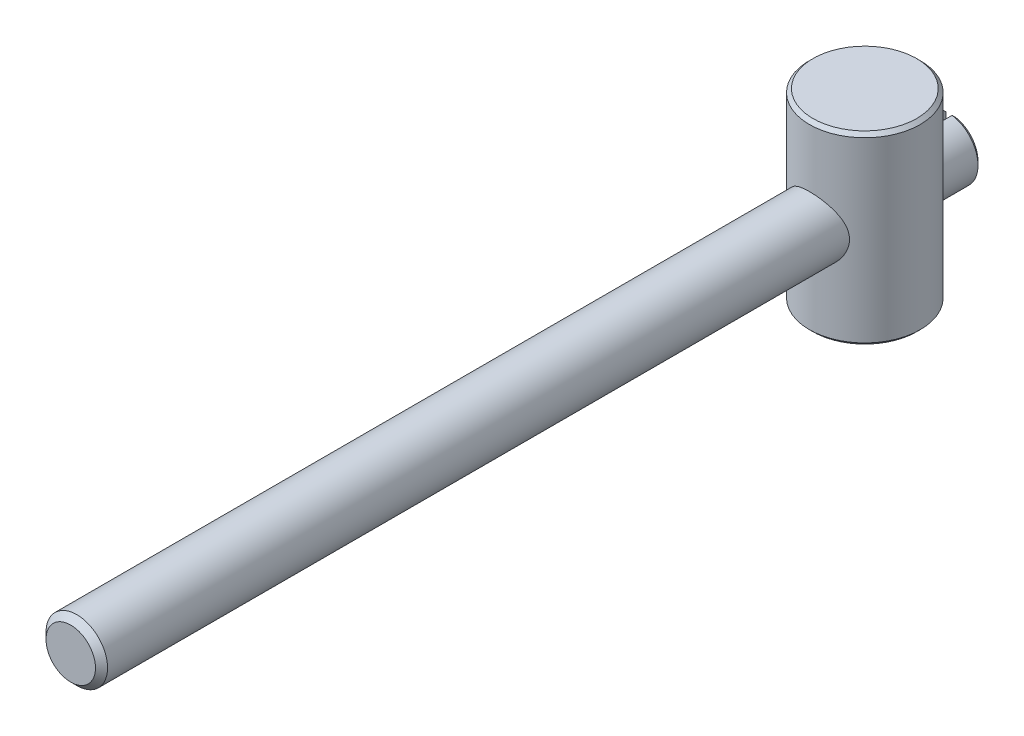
ISO-10303-21;
HEADER;
FILE_DESCRIPTION(('STEP AP214'),'2;1');
FILE_NAME('part.step','',(''),(''),'','','');
FILE_SCHEMA(('AUTOMOTIVE_DESIGN { 1 0 10303 214 1 1 1 1 }'));
ENDSEC;
DATA;
#1=APPLICATION_CONTEXT('core data for automotive mechanical design processes');
#2=APPLICATION_PROTOCOL_DEFINITION('international standard','automotive_design',2000,#1);
#3=PRODUCT_CONTEXT('',#1,'mechanical');
#4=PRODUCT('Part','Part','',(#3));
#5=PRODUCT_RELATED_PRODUCT_CATEGORY('part','',(#4));
#6=PRODUCT_DEFINITION_FORMATION('','',#4);
#7=PRODUCT_DEFINITION_CONTEXT('part definition',#1,'design');
#8=PRODUCT_DEFINITION('design','',#6,#7);
#9=PRODUCT_DEFINITION_SHAPE('','',#8);
#10=(LENGTH_UNIT() NAMED_UNIT(*) SI_UNIT(.MILLI.,.METRE.));
#11=(NAMED_UNIT(*) PLANE_ANGLE_UNIT() SI_UNIT($,.RADIAN.));
#12=(NAMED_UNIT(*) SI_UNIT($,.STERADIAN.) SOLID_ANGLE_UNIT());
#13=UNCERTAINTY_MEASURE_WITH_UNIT(LENGTH_MEASURE(1.E-05),#10,'distance_accuracy_value','');
#14=(GEOMETRIC_REPRESENTATION_CONTEXT(3) GLOBAL_UNCERTAINTY_ASSIGNED_CONTEXT((#13)) GLOBAL_UNIT_ASSIGNED_CONTEXT((#10,
#11,#12)) REPRESENTATION_CONTEXT('',''));
#15=CARTESIAN_POINT('',(0.,0.,0.));
#16=DIRECTION('',(0.,0.,1.));
#17=DIRECTION('',(1.,0.,0.));
#18=AXIS2_PLACEMENT_3D('',#15,#16,#17);
#19=CARTESIAN_POINT('',(0.,0.,-10.2));
#20=DIRECTION('',(0.,0.,1.));
#21=DIRECTION('',(1.,0.,0.));
#22=AXIS2_PLACEMENT_3D('',#19,#20,#21);
#23=CYLINDRICAL_SURFACE('',#22,2.5);
#24=CARTESIAN_POINT('',(2.5,0.,-10.9583426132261));
#25=CARTESIAN_POINT('',(2.4999886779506,-0.127867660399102,-10.9583273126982));
#26=CARTESIAN_POINT('',(2.49012046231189,-0.255847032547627,-10.9516829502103));
#27=CARTESIAN_POINT('',(2.45123834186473,-0.507679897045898,-10.92615160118));
#28=CARTESIAN_POINT('',(2.42219296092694,-0.631526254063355,-10.9072444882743));
#29=CARTESIAN_POINT('',(2.34672518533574,-0.870945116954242,-10.8601006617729));
#30=CARTESIAN_POINT('',(2.30041313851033,-0.986564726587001,-10.8319233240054));
#31=CARTESIAN_POINT('',(2.19206578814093,-1.20834600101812,-10.7695105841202));
#32=CARTESIAN_POINT('',(2.13002699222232,-1.31450555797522,-10.7352738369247));
#33=CARTESIAN_POINT('',(1.98449846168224,-1.52641671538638,-10.6603059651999));
#34=CARTESIAN_POINT('',(1.89945493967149,-1.63099357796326,-10.6192693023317));
#35=CARTESIAN_POINT('',(1.71353751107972,-1.82534633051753,-10.5377770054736));
#36=CARTESIAN_POINT('',(1.61265398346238,-1.91511315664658,-10.4973217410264));
#37=CARTESIAN_POINT('',(1.3870985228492,-2.08508983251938,-10.4173035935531));
#38=CARTESIAN_POINT('',(1.26111369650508,-2.16376032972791,-10.3781335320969));
#39=CARTESIAN_POINT('',(0.995108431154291,-2.29824166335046,-10.3092628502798));
#40=CARTESIAN_POINT('',(0.855099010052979,-2.35407027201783,-10.2795548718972));
#41=CARTESIAN_POINT('',(0.577542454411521,-2.43630568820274,-10.2351937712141));
#42=CARTESIAN_POINT('',(0.440787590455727,-2.46480060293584,-10.2194803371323));
#43=CARTESIAN_POINT('',(0.163616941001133,-2.49853448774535,-10.2008373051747));
#44=CARTESIAN_POINT('',(0.0232040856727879,-2.50379152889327,-10.1978977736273));
#45=CARTESIAN_POINT('',(-0.241178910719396,-2.4914765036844,-10.2047304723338));
#46=CARTESIAN_POINT('',(-0.365303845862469,-2.47628215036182,-10.2131788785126));
#47=CARTESIAN_POINT('',(-0.608906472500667,-2.42789099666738,-10.2397034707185));
#48=CARTESIAN_POINT('',(-0.728383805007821,-2.39469280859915,-10.2577803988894));
#49=CARTESIAN_POINT('',(-0.960979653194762,-2.31126649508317,-10.3021939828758));
#50=CARTESIAN_POINT('',(-1.07401990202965,-2.26086630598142,-10.3286138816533));
#51=CARTESIAN_POINT('',(-1.29025059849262,-2.14483738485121,-10.3874800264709));
#52=CARTESIAN_POINT('',(-1.39343793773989,-2.07920386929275,-10.4199281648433));
#53=CARTESIAN_POINT('',(-1.59909620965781,-1.92640653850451,-10.4921471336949));
#54=CARTESIAN_POINT('',(-1.70025747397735,-1.83767397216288,-10.5323306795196));
#55=CARTESIAN_POINT('',(-1.88703556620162,-1.64533173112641,-10.6134989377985));
#56=CARTESIAN_POINT('',(-1.97263574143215,-1.54170632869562,-10.6544844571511));
#57=CARTESIAN_POINT('',(-2.13367090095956,-1.31107929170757,-10.736876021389));
#58=CARTESIAN_POINT('',(-2.2074790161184,-1.1828097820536,-10.7779828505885));
#59=CARTESIAN_POINT('',(-2.30082855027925,-0.98066900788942,-10.8325082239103));
#60=CARTESIAN_POINT('',(-2.32905476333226,-0.91165285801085,-10.8494965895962));
#61=CARTESIAN_POINT('',(-2.3793879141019,-0.770776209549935,-10.8803947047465));
#62=CARTESIAN_POINT('',(-2.4014990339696,-0.698917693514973,-10.8943065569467));
#63=CARTESIAN_POINT('',(-2.43774893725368,-0.558744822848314,-10.9174339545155));
#64=CARTESIAN_POINT('',(-2.45238335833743,-0.490605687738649,-10.92693581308));
#65=CARTESIAN_POINT('',(-2.47593920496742,-0.352979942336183,-10.9423512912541));
#66=CARTESIAN_POINT('',(-2.48486399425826,-0.283494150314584,-10.9482670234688));
#67=CARTESIAN_POINT('',(-2.49684067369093,-0.143844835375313,-10.9562264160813));
#68=CARTESIAN_POINT('',(-2.49989709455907,-0.0736818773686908,-10.9582730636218));
#69=CARTESIAN_POINT('',(-2.5000979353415,0.0666321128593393,-10.958408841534));
#70=CARTESIAN_POINT('',(-2.49724303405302,0.136783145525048,-10.9564984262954));
#71=CARTESIAN_POINT('',(-2.48160454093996,0.325212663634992,-10.9460933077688));
#72=CARTESIAN_POINT('',(-2.4632791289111,0.442885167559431,-10.9339318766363));
#73=CARTESIAN_POINT('',(-2.41059641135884,0.673061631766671,-10.9000032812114));
#74=CARTESIAN_POINT('',(-2.37623178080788,0.785563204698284,-10.8782317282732));
#75=CARTESIAN_POINT('',(-2.29111009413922,1.00774180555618,-10.8265799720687));
#76=CARTESIAN_POINT('',(-2.23973536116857,1.11711092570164,-10.796402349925));
#77=CARTESIAN_POINT('',(-2.12255957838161,1.32632576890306,-10.7314706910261));
#78=CARTESIAN_POINT('',(-2.05675148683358,1.42616680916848,-10.6967144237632));
#79=CARTESIAN_POINT('',(-1.90016864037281,1.63049062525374,-10.6197869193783));
#80=CARTESIAN_POINT('',(-1.80707526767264,1.73309682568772,-10.5773277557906));
#81=CARTESIAN_POINT('',(-1.60470900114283,1.92199935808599,-10.4944234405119));
#82=CARTESIAN_POINT('',(-1.49542618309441,2.00828561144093,-10.453979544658));
#83=CARTESIAN_POINT('',(-1.25626042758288,2.16643294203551,-10.376991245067));
#84=CARTESIAN_POINT('',(-1.12558547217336,2.23726807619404,-10.3407737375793));
#85=CARTESIAN_POINT('',(-0.851602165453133,2.35519631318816,-10.2790936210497));
#86=CARTESIAN_POINT('',(-0.708307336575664,2.40231447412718,-10.2536196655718));
#87=CARTESIAN_POINT('',(-0.428990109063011,2.46664777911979,-10.218514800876));
#88=CARTESIAN_POINT('',(-0.293732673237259,2.48643742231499,-10.2075252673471));
#89=CARTESIAN_POINT('',(-0.0213910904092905,2.50362240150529,-10.1979932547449));
#90=CARTESIAN_POINT('',(0.115692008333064,2.50103007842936,-10.1994439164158));
#91=CARTESIAN_POINT('',(0.374337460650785,2.47491437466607,-10.2138982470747));
#92=CARTESIAN_POINT('',(0.49616574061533,2.45334235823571,-10.2258246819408));
#93=CARTESIAN_POINT('',(0.734167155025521,2.39292228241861,-10.2586674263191));
#94=CARTESIAN_POINT('',(0.8503396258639,2.3540722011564,-10.279584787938));
#95=CARTESIAN_POINT('',(1.0781477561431,2.25905612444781,-10.3294567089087));
#96=CARTESIAN_POINT('',(1.18950897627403,2.202363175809,-10.358652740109));
#97=CARTESIAN_POINT('',(1.40148896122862,2.07393542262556,-10.422372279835));
#98=CARTESIAN_POINT('',(1.50210346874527,2.00219469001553,-10.4568978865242));
#99=CARTESIAN_POINT('',(1.70217916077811,1.83613517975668,-10.532828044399));
#100=CARTESIAN_POINT('',(1.8001424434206,1.74016022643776,-10.5745654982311));
#101=CARTESIAN_POINT('',(1.97933250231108,1.53330418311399,-10.6574745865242));
#102=CARTESIAN_POINT('',(2.06053826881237,1.42240466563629,-10.6986454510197));
#103=CARTESIAN_POINT('',(2.20944802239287,1.17899936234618,-10.7787759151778));
#104=CARTESIAN_POINT('',(2.27579178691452,1.04552040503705,-10.8173734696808));
#105=CARTESIAN_POINT('',(2.35707752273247,0.83652666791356,-10.8665699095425));
#106=CARTESIAN_POINT('',(2.38112244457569,0.765460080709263,-10.881510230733));
#107=CARTESIAN_POINT('',(2.4228459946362,0.620861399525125,-10.9078467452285));
#108=CARTESIAN_POINT('',(2.44052862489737,0.547330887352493,-10.9192451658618));
#109=CARTESIAN_POINT('',(2.4697920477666,0.395409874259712,-10.9382915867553));
#110=CARTESIAN_POINT('',(2.48109451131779,0.316943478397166,-10.9457676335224));
#111=CARTESIAN_POINT('',(2.49620181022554,0.158999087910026,-10.9557977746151));
#112=CARTESIAN_POINT('',(2.50000704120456,0.0795211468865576,-10.9583521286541));
#113=CARTESIAN_POINT('',(2.5,0.,-10.9583426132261));
#114=B_SPLINE_CURVE_WITH_KNOTS('',3,(#24,#25,#26,#27,#28,#29,#30,#31,#32,#33,#34,#35,#36,#37,
#38,#39,#40,#41,#42,#43,#44,#45,#46,#47,#48,#49,#50,#51,#52,#53,#54,#55,#56,#57,#58,#59,#60,#61,
#62,#63,#64,#65,#66,#67,#68,#69,#70,#71,#72,#73,#74,#75,#76,#77,#78,#79,#80,#81,#82,#83,#84,#85,
#86,#87,#88,#89,#90,#91,#92,#93,#94,#95,#96,#97,#98,#99,#100,#101,#102,#103,#104,#105,#106,#107,
#108,#109,#110,#111,#112,#113),.UNSPECIFIED.,.T.,.F.,(4,2,2,2,2,2,2,2,2,2,2,2,2,2,2,2,2,2,2,2,2,
2,2,2,2,2,2,2,2,2,2,2,2,2,2,2,2,2,2,2,2,2,2,2,4),(0.,0.383275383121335,0.767181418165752,
1.14867490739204,1.53025318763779,1.95124472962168,2.37249297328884,2.8308639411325,
3.2888775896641,3.70817544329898,4.12714717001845,4.50138183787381,4.8756453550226,
5.25376784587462,5.63200923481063,6.05157027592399,6.47157769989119,6.92969119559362,
7.15882945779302,7.38781062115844,7.59850621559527,7.80907756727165,8.01948627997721,
8.22987083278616,8.58719279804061,8.94467811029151,9.31690871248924,9.68932132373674,
10.122176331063,10.5552977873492,11.0117233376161,11.4676656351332,11.8767730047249,
12.2856548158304,12.6568475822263,13.0280837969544,13.4115163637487,13.7951002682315,
14.2233400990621,14.6521136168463,15.1111969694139,15.3403711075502,15.5694008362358,
15.80777312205,16.0461328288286),.UNSPECIFIED.);
#115=CARTESIAN_POINT('',(2.5,0.,-10.9583426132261));
#116=VERTEX_POINT('',#115);
#117=EDGE_CURVE('E196',#116,#116,#114,.T.);
#118=ORIENTED_EDGE('',*,*,#117,.F.);
#119=EDGE_LOOP('',(#118));
#120=FACE_BOUND('',#119,.T.);
#121=CARTESIAN_POINT('',(0.,0.,49.3095));
#122=DIRECTION('',(0.,0.,1.));
#123=DIRECTION('',(1.,0.,0.));
#124=AXIS2_PLACEMENT_3D('',#121,#122,#123);
#125=CIRCLE('',#124,2.5);
#126=CARTESIAN_POINT('',(2.5,0.,49.3095));
#127=VERTEX_POINT('',#126);
#128=EDGE_CURVE('E204',#127,#127,#125,.T.);
#129=ORIENTED_EDGE('',*,*,#128,.F.);
#130=EDGE_LOOP('',(#129));
#131=FACE_BOUND('',#130,.T.);
#132=ADVANCED_FACE('F14',(#120,#131),#23,.T.);
#133=CARTESIAN_POINT('',(0.,0.,-21.3935));
#134=DIRECTION('',(0.,0.,1.));
#135=DIRECTION('',(1.,0.,0.));
#136=AXIS2_PLACEMENT_3D('',#133,#134,#135);
#137=CIRCLE('',#136,2.5);
#138=CARTESIAN_POINT('',(-0.4,2.46779253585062,-21.3935));
#139=VERTEX_POINT('',#138);
#140=CARTESIAN_POINT('',(-0.4,-2.46779253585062,-21.3935));
#141=VERTEX_POINT('',#140);
#142=EDGE_CURVE('E101',#139,#141,#137,.T.);
#143=ORIENTED_EDGE('',*,*,#142,.T.);
#144=DIRECTION('',(0.,0.,1.));
#145=VECTOR('',#144,1.);
#146=CARTESIAN_POINT('',(-0.4,-2.46779253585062,-10.2));
#147=LINE('',#146,#145);
#148=CARTESIAN_POINT('',(-0.4,-2.46779253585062,-20.296815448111));
#149=VERTEX_POINT('',#148);
#150=EDGE_CURVE('E148',#141,#149,#147,.T.);
#151=ORIENTED_EDGE('',*,*,#150,.T.);
#152=CARTESIAN_POINT('',(0.4,-2.46779253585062,-20.296815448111));
#153=CARTESIAN_POINT('',(0.333698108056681,-2.47854531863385,-20.2976618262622));
#154=CARTESIAN_POINT('',(0.266959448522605,-2.48661458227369,-20.298300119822));
#155=CARTESIAN_POINT('',(0.133478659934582,-2.49732458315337,-20.2991493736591));
#156=CARTESIAN_POINT('',(0.066739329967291,-2.5,-20.2993630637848));
#157=CARTESIAN_POINT('',(-0.066739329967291,-2.5,-20.2993630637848));
#158=CARTESIAN_POINT('',(-0.133478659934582,-2.49732458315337,-20.2991493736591));
#159=CARTESIAN_POINT('',(-0.266959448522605,-2.48661458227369,-20.298300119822));
#160=CARTESIAN_POINT('',(-0.333698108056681,-2.47854531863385,-20.2976618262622));
#161=CARTESIAN_POINT('',(-0.4,-2.46779253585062,-20.296815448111));
#162=B_SPLINE_CURVE_WITH_KNOTS('',3,(#152,#153,#154,#155,#156,#157,#158,#159,#160,#161),
.UNSPECIFIED.,.F.,.F.,(4,2,2,2,4),(0.,0.201464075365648,0.401628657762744,0.601793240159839,
0.803257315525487),.UNSPECIFIED.);
#163=CARTESIAN_POINT('',(0.4,-2.46779253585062,-20.296815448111));
#164=VERTEX_POINT('',#163);
#165=EDGE_CURVE('E141',#164,#149,#162,.T.);
#166=ORIENTED_EDGE('',*,*,#165,.F.);
#167=DIRECTION('',(0.,0.,1.));
#168=VECTOR('',#167,1.);
#169=CARTESIAN_POINT('',(0.4,-2.46779253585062,-10.2));
#170=LINE('',#169,#168);
#171=CARTESIAN_POINT('',(0.4,-2.46779253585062,-21.3935));
#172=VERTEX_POINT('',#171);
#173=EDGE_CURVE('E32',#172,#164,#170,.T.);
#174=ORIENTED_EDGE('',*,*,#173,.F.);
#175=CARTESIAN_POINT('',(0.4,2.46779253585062,-21.3935));
#176=VERTEX_POINT('',#175);
#177=EDGE_CURVE('E86',#172,#176,#137,.T.);
#178=ORIENTED_EDGE('',*,*,#177,.T.);
#179=DIRECTION('',(0.,0.,1.));
#180=VECTOR('',#179,1.);
#181=CARTESIAN_POINT('',(0.4,2.46779253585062,-10.2));
#182=LINE('',#181,#180);
#183=CARTESIAN_POINT('',(0.4,2.46779253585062,-20.296815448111));
#184=VERTEX_POINT('',#183);
#185=EDGE_CURVE('E38',#184,#176,#182,.F.);
#186=ORIENTED_EDGE('',*,*,#185,.F.);
#187=CARTESIAN_POINT('',(-0.4,2.46779253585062,-20.296815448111));
#188=CARTESIAN_POINT('',(-0.333698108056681,2.47854531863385,-20.2976618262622));
#189=CARTESIAN_POINT('',(-0.266959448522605,2.48661458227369,-20.298300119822));
#190=CARTESIAN_POINT('',(-0.133478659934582,2.49732458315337,-20.2991493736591));
#191=CARTESIAN_POINT('',(-0.066739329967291,2.5,-20.2993630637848));
#192=CARTESIAN_POINT('',(0.066739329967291,2.5,-20.2993630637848));
#193=CARTESIAN_POINT('',(0.133478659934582,2.49732458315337,-20.2991493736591));
#194=CARTESIAN_POINT('',(0.266959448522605,2.48661458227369,-20.298300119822));
#195=CARTESIAN_POINT('',(0.333698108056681,2.47854531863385,-20.2976618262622));
#196=CARTESIAN_POINT('',(0.4,2.46779253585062,-20.296815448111));
#197=B_SPLINE_CURVE_WITH_KNOTS('',3,(#187,#188,#189,#190,#191,#192,#193,#194,#195,#196),
.UNSPECIFIED.,.F.,.F.,(4,2,2,2,4),(0.,0.201464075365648,0.401628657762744,0.601793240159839,
0.803257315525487),.UNSPECIFIED.);
#198=CARTESIAN_POINT('',(-0.4,2.46779253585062,-20.296815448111));
#199=VERTEX_POINT('',#198);
#200=EDGE_CURVE('E73',#199,#184,#197,.T.);
#201=ORIENTED_EDGE('',*,*,#200,.F.);
#202=DIRECTION('',(0.,0.,1.));
#203=VECTOR('',#202,1.);
#204=CARTESIAN_POINT('',(-0.4,2.46779253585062,-10.2));
#205=LINE('',#204,#203);
#206=EDGE_CURVE('E79',#199,#139,#205,.F.);
#207=ORIENTED_EDGE('',*,*,#206,.T.);
#208=EDGE_LOOP('',(#143,#151,#166,#174,#178,#186,#201,#207));
#209=FACE_BOUND('',#208,.T.);
#210=CARTESIAN_POINT('',(2.5,0.,-18.441657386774));
#211=CARTESIAN_POINT('',(2.4999886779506,0.127867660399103,-18.4416726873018));
#212=CARTESIAN_POINT('',(2.49012046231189,0.255847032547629,-18.4483170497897));
#213=CARTESIAN_POINT('',(2.45123834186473,0.507679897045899,-18.47384839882));
#214=CARTESIAN_POINT('',(2.42219296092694,0.631526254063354,-18.4927555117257));
#215=CARTESIAN_POINT('',(2.34672518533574,0.870945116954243,-18.5398993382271));
#216=CARTESIAN_POINT('',(2.30041313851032,0.986564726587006,-18.5680766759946));
#217=CARTESIAN_POINT('',(2.19206578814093,1.20834600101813,-18.6304894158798));
#218=CARTESIAN_POINT('',(2.13002699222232,1.31450555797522,-18.6647261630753));
#219=CARTESIAN_POINT('',(1.98449846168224,1.52641671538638,-18.7396940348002));
#220=CARTESIAN_POINT('',(1.89945493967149,1.63099357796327,-18.7807306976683));
#221=CARTESIAN_POINT('',(1.71353751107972,1.82534633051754,-18.8622229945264));
#222=CARTESIAN_POINT('',(1.61265398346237,1.91511315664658,-18.9026782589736));
#223=CARTESIAN_POINT('',(1.3870985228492,2.08508983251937,-18.982696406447));
#224=CARTESIAN_POINT('',(1.26111369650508,2.16376032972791,-19.0218664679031));
#225=CARTESIAN_POINT('',(0.995108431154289,2.29824166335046,-19.0907371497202));
#226=CARTESIAN_POINT('',(0.855099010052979,2.35407027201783,-19.1204451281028));
#227=CARTESIAN_POINT('',(0.577542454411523,2.43630568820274,-19.1648062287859));
#228=CARTESIAN_POINT('',(0.440787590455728,2.46480060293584,-19.1805196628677));
#229=CARTESIAN_POINT('',(0.163616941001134,2.49853448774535,-19.1991626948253));
#230=CARTESIAN_POINT('',(0.0232040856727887,2.50379152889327,-19.2021022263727));
#231=CARTESIAN_POINT('',(-0.241178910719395,2.4914765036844,-19.1952695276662));
#232=CARTESIAN_POINT('',(-0.365303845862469,2.47628215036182,-19.1868211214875));
#233=CARTESIAN_POINT('',(-0.608906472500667,2.42789099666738,-19.1602965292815));
#234=CARTESIAN_POINT('',(-0.728383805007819,2.39469280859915,-19.1422196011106));
#235=CARTESIAN_POINT('',(-0.960979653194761,2.31126649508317,-19.0978060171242));
#236=CARTESIAN_POINT('',(-1.07401990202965,2.26086630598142,-19.0713861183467));
#237=CARTESIAN_POINT('',(-1.29025059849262,2.14483738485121,-19.0125199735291));
#238=CARTESIAN_POINT('',(-1.39343793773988,2.07920386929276,-18.9800718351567));
#239=CARTESIAN_POINT('',(-1.59909620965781,1.9264065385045,-18.9078528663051));
#240=CARTESIAN_POINT('',(-1.70025747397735,1.83767397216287,-18.8676693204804));
#241=CARTESIAN_POINT('',(-1.88703556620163,1.64533173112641,-18.7865010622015));
#242=CARTESIAN_POINT('',(-1.97263574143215,1.54170632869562,-18.7455155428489));
#243=CARTESIAN_POINT('',(-2.13367090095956,1.31107929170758,-18.663123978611));
#244=CARTESIAN_POINT('',(-2.2074790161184,1.1828097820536,-18.6220171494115));
#245=CARTESIAN_POINT('',(-2.30082855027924,0.980669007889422,-18.5674917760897));
#246=CARTESIAN_POINT('',(-2.32905476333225,0.911652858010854,-18.5505034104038));
#247=CARTESIAN_POINT('',(-2.3793879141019,0.770776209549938,-18.5196052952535));
#248=CARTESIAN_POINT('',(-2.4014990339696,0.698917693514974,-18.5056934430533));
#249=CARTESIAN_POINT('',(-2.43774893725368,0.558744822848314,-18.4825660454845));
#250=CARTESIAN_POINT('',(-2.45238335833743,0.490605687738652,-18.47306418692));
#251=CARTESIAN_POINT('',(-2.47593920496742,0.352979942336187,-18.4576487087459));
#252=CARTESIAN_POINT('',(-2.48486399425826,0.283494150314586,-18.4517329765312));
#253=CARTESIAN_POINT('',(-2.49684067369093,0.143844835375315,-18.4437735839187));
#254=CARTESIAN_POINT('',(-2.49989709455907,0.0736818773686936,-18.4417269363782));
#255=CARTESIAN_POINT('',(-2.5000979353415,-0.0666321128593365,-18.441591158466));
#256=CARTESIAN_POINT('',(-2.49724303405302,-0.136783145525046,-18.4435015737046));
#257=CARTESIAN_POINT('',(-2.48160454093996,-0.325212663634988,-18.4539066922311));
#258=CARTESIAN_POINT('',(-2.46327912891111,-0.442885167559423,-18.4660681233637));
#259=CARTESIAN_POINT('',(-2.41059641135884,-0.673061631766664,-18.4999967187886));
#260=CARTESIAN_POINT('',(-2.37623178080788,-0.785563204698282,-18.5217682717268));
#261=CARTESIAN_POINT('',(-2.29111009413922,-1.00774180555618,-18.5734200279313));
#262=CARTESIAN_POINT('',(-2.23973536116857,-1.11711092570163,-18.603597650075));
#263=CARTESIAN_POINT('',(-2.12255957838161,-1.32632576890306,-18.668529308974));
#264=CARTESIAN_POINT('',(-2.05675148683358,-1.42616680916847,-18.7032855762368));
#265=CARTESIAN_POINT('',(-1.90016864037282,-1.63049062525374,-18.7802130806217));
#266=CARTESIAN_POINT('',(-1.80707526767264,-1.73309682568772,-18.8226722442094));
#267=CARTESIAN_POINT('',(-1.60470900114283,-1.92199935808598,-18.9055765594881));
#268=CARTESIAN_POINT('',(-1.49542618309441,-2.00828561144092,-18.946020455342));
#269=CARTESIAN_POINT('',(-1.25626042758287,-2.16643294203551,-19.0230087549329));
#270=CARTESIAN_POINT('',(-1.12558547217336,-2.23726807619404,-19.0592262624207));
#271=CARTESIAN_POINT('',(-0.851602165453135,-2.35519631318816,-19.1209063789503));
#272=CARTESIAN_POINT('',(-0.708307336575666,-2.40231447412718,-19.1463803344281));
#273=CARTESIAN_POINT('',(-0.428990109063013,-2.46664777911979,-19.181485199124));
#274=CARTESIAN_POINT('',(-0.293732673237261,-2.48643742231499,-19.1924747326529));
#275=CARTESIAN_POINT('',(-0.0213910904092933,-2.50362240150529,-19.2020067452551));
#276=CARTESIAN_POINT('',(0.115692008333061,-2.50103007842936,-19.2005560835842));
#277=CARTESIAN_POINT('',(0.374337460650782,-2.47491437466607,-19.1861017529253));
#278=CARTESIAN_POINT('',(0.496165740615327,-2.45334235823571,-19.1741753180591));
#279=CARTESIAN_POINT('',(0.73416715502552,-2.39292228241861,-19.1413325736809));
#280=CARTESIAN_POINT('',(0.8503396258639,-2.3540722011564,-19.120415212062));
#281=CARTESIAN_POINT('',(1.07814775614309,-2.25905612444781,-19.0705432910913));
#282=CARTESIAN_POINT('',(1.18950897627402,-2.202363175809,-19.041347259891));
#283=CARTESIAN_POINT('',(1.40148896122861,-2.07393542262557,-18.977627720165));
#284=CARTESIAN_POINT('',(1.50210346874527,-2.00219469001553,-18.9431021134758));
#285=CARTESIAN_POINT('',(1.7021791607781,-1.83613517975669,-18.867171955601));
#286=CARTESIAN_POINT('',(1.80014244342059,-1.74016022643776,-18.825434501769));
#287=CARTESIAN_POINT('',(1.97933250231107,-1.533304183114,-18.7425254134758));
#288=CARTESIAN_POINT('',(2.06053826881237,-1.42240466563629,-18.7013545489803));
#289=CARTESIAN_POINT('',(2.20944802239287,-1.17899936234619,-18.6212240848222));
#290=CARTESIAN_POINT('',(2.27579178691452,-1.04552040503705,-18.5826265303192));
#291=CARTESIAN_POINT('',(2.35707752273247,-0.83652666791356,-18.5334300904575));
#292=CARTESIAN_POINT('',(2.38112244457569,-0.765460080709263,-18.518489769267));
#293=CARTESIAN_POINT('',(2.4228459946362,-0.620861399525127,-18.4921532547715));
#294=CARTESIAN_POINT('',(2.44052862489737,-0.547330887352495,-18.4807548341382));
#295=CARTESIAN_POINT('',(2.4697920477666,-0.395409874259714,-18.4617084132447));
#296=CARTESIAN_POINT('',(2.48109451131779,-0.316943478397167,-18.4542323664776));
#297=CARTESIAN_POINT('',(2.49620181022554,-0.158999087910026,-18.4442022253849));
#298=CARTESIAN_POINT('',(2.50000704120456,-0.0795211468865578,-18.4416478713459));
#299=CARTESIAN_POINT('',(2.5,0.,-18.441657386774));
#300=B_SPLINE_CURVE_WITH_KNOTS('',3,(#210,#211,#212,#213,#214,#215,#216,#217,#218,#219,#220,
#221,#222,#223,#224,#225,#226,#227,#228,#229,#230,#231,#232,#233,#234,#235,#236,#237,#238,#239,
#240,#241,#242,#243,#244,#245,#246,#247,#248,#249,#250,#251,#252,#253,#254,#255,#256,#257,#258,
#259,#260,#261,#262,#263,#264,#265,#266,#267,#268,#269,#270,#271,#272,#273,#274,#275,#276,#277,
#278,#279,#280,#281,#282,#283,#284,#285,#286,#287,#288,#289,#290,#291,#292,#293,#294,#295,#296,
#297,#298,#299),.UNSPECIFIED.,.T.,.F.,(4,2,2,2,2,2,2,2,2,2,2,2,2,2,2,2,2,2,2,2,2,2,2,2,2,2,2,2,
2,2,2,2,2,2,2,2,2,2,2,2,2,2,2,2,4),(0.,0.383275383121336,0.767181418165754,1.14867490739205,
1.53025318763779,1.95124472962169,2.37249297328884,2.8308639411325,3.2888775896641,
3.70817544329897,4.12714717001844,4.50138183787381,4.8756453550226,5.25376784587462,
5.63200923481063,6.05157027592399,6.47157769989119,6.92969119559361,7.15882945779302,
7.38781062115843,7.59850621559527,7.80907756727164,8.0194862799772,8.22987083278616,
8.5871927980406,8.9446781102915,9.31690871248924,9.68932132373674,10.122176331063,
10.5552977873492,11.0117233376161,11.4676656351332,11.8767730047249,12.2856548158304,
12.6568475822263,13.0280837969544,13.4115163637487,13.7951002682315,14.2233400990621,
14.6521136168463,15.1111969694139,15.3403711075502,15.5694008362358,15.80777312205,
16.0461328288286),.UNSPECIFIED.);
#301=CARTESIAN_POINT('',(2.5,0.,-18.441657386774));
#302=VERTEX_POINT('',#301);
#303=EDGE_CURVE('E192',#302,#302,#300,.T.);
#304=ORIENTED_EDGE('',*,*,#303,.F.);
#305=EDGE_LOOP('',(#304));
#306=FACE_BOUND('',#305,.T.);
#307=ADVANCED_FACE('F83',(#209,#306),#23,.T.);
#308=CARTESIAN_POINT('',(0.,0.,-21.7));
#309=DIRECTION('',(0.,0.,1.));
#310=DIRECTION('',(1.,0.,0.));
#311=AXIS2_PLACEMENT_3D('',#308,#309,#310);
#312=PLANE('',#311);
#313=DIRECTION('',(0.,-1.,0.));
#314=VECTOR('',#313,1.);
#315=CARTESIAN_POINT('',(0.4,0.,-21.7));
#316=LINE('',#315,#314);
#317=CARTESIAN_POINT('',(0.4,2.15672025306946,-21.7));
#318=VERTEX_POINT('',#317);
#319=CARTESIAN_POINT('',(0.4,-2.15672025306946,-21.7));
#320=VERTEX_POINT('',#319);
#321=EDGE_CURVE('E116',#318,#320,#316,.T.);
#322=ORIENTED_EDGE('',*,*,#321,.F.);
#323=CARTESIAN_POINT('',(0.,0.,-21.7));
#324=DIRECTION('',(0.,0.,1.));
#325=DIRECTION('',(1.,0.,0.));
#326=AXIS2_PLACEMENT_3D('',#323,#324,#325);
#327=CIRCLE('',#326,2.1935);
#328=EDGE_CURVE('E90',#320,#318,#327,.T.);
#329=ORIENTED_EDGE('',*,*,#328,.F.);
#330=EDGE_LOOP('',(#322,#329));
#331=FACE_BOUND('',#330,.T.);
#332=ADVANCED_FACE('F157',(#331),#312,.F.);
#333=CARTESIAN_POINT('',(0.,0.,-21.7));
#334=DIRECTION('',(0.,0.,1.));
#335=DIRECTION('',(1.,0.,0.));
#336=AXIS2_PLACEMENT_3D('',#333,#334,#335);
#337=CONICAL_SURFACE('',#336,2.1935,0.785398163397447);
#338=CARTESIAN_POINT('',(0.4,2.46850166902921,-21.3928));
#339=CARTESIAN_POINT('',(0.4,2.39793497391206,-21.4624547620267));
#340=CARTESIAN_POINT('',(0.4,2.32733326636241,-21.5320741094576));
#341=CARTESIAN_POINT('',(0.4,2.18597809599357,-21.6712614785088));
#342=CARTESIAN_POINT('',(0.4,2.11522456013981,-21.7408294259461));
#343=CARTESIAN_POINT('',(0.4,1.97263911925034,-21.8807619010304));
#344=CARTESIAN_POINT('',(0.4,1.90080545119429,-21.9511246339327));
#345=CARTESIAN_POINT('',(0.4,1.75700155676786,-22.0916061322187));
#346=CARTESIAN_POINT('',(0.4,1.68503146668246,-22.1617250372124));
#347=CARTESIAN_POINT('',(0.4,1.5086325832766,-22.3329478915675));
#348=CARTESIAN_POINT('',(0.4,1.40406116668,-22.4339055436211));
#349=CARTESIAN_POINT('',(0.4,1.24630024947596,-22.5846719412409));
#350=CARTESIAN_POINT('',(0.4,1.1934932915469,-22.6348806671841));
#351=CARTESIAN_POINT('',(0.4,1.08751861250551,-22.73488634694));
#352=CARTESIAN_POINT('',(0.4,1.03435099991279,-22.7846834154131));
#353=CARTESIAN_POINT('',(0.4,0.928027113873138,-22.8831356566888));
#354=CARTESIAN_POINT('',(0.4,0.87487688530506,-22.9317973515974));
#355=CARTESIAN_POINT('',(0.4,0.767646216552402,-23.0282154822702));
#356=CARTESIAN_POINT('',(0.4,0.713564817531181,-23.0759708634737));
#357=CARTESIAN_POINT('',(0.4,0.63143350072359,-23.1461630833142));
#358=CARTESIAN_POINT('',(0.4,0.603955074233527,-23.1692668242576));
#359=CARTESIAN_POINT('',(0.4,0.548479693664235,-23.2148412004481));
#360=CARTESIAN_POINT('',(0.4,0.520482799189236,-23.2373119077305));
#361=CARTESIAN_POINT('',(0.4,0.463815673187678,-23.2812861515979));
#362=CARTESIAN_POINT('',(0.4,0.435146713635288,-23.3027913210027));
#363=CARTESIAN_POINT('',(0.4,0.376790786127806,-23.3443654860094));
#364=CARTESIAN_POINT('',(0.4,0.347104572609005,-23.364435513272));
#365=CARTESIAN_POINT('',(0.4,0.309473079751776,-23.3877901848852));
#366=CARTESIAN_POINT('',(0.4,0.302223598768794,-23.3921969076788));
#367=CARTESIAN_POINT('',(0.4,0.287631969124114,-23.4008566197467));
#368=CARTESIAN_POINT('',(0.4,0.28028980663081,-23.4051095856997));
#369=CARTESIAN_POINT('',(0.4,0.258114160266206,-23.4176076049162));
#370=CARTESIAN_POINT('',(0.4,0.243131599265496,-23.4255917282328));
#371=CARTESIAN_POINT('',(0.4,0.212839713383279,-23.4405880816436));
#372=CARTESIAN_POINT('',(0.4,0.197534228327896,-23.4476079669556));
#373=CARTESIAN_POINT('',(0.4,0.166442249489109,-23.460484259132));
#374=CARTESIAN_POINT('',(0.4,0.150655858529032,-23.4663409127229));
#375=CARTESIAN_POINT('',(0.4,0.111435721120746,-23.4788472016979));
#376=CARTESIAN_POINT('',(0.4,0.0877285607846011,-23.4846874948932));
#377=CARTESIAN_POINT('',(0.4,0.0397057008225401,-23.4922264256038));
#378=CARTESIAN_POINT('',(0.4,0.0153922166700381,-23.4939383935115));
#379=CARTESIAN_POINT('',(0.4,-0.0331703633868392,-23.4928640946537));
#380=CARTESIAN_POINT('',(0.4,-0.0574192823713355,-23.4900702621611));
#381=CARTESIAN_POINT('',(0.4,-0.10517632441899,-23.4805736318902));
#382=CARTESIAN_POINT('',(0.4,-0.128681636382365,-23.4738575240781));
#383=CARTESIAN_POINT('',(0.4,-0.178283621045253,-23.4562788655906));
#384=CARTESIAN_POINT('',(0.4,-0.20420033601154,-23.4449277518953));
#385=CARTESIAN_POINT('',(0.4,-0.254817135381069,-23.4197398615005));
#386=CARTESIAN_POINT('',(0.4,-0.279514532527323,-23.4058978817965));
#387=CARTESIAN_POINT('',(0.4,-0.328121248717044,-23.3765020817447));
#388=CARTESIAN_POINT('',(0.4,-0.352022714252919,-23.3609354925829));
#389=CARTESIAN_POINT('',(0.4,-0.399055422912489,-23.3287412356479));
#390=CARTESIAN_POINT('',(0.4,-0.422187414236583,-23.3121146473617));
#391=CARTESIAN_POINT('',(0.4,-0.4702689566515,-23.2763546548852));
#392=CARTESIAN_POINT('',(0.4,-0.495157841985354,-23.2571402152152));
#393=CARTESIAN_POINT('',(0.4,-0.544438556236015,-23.21808210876));
#394=CARTESIAN_POINT('',(0.4,-0.568830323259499,-23.1982383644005));
#395=CARTESIAN_POINT('',(0.4,-0.641472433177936,-23.1380236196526));
#396=CARTESIAN_POINT('',(0.4,-0.689168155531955,-23.0969855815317));
#397=CARTESIAN_POINT('',(0.4,-0.783758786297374,-23.013853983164));
#398=CARTESIAN_POINT('',(0.4,-0.83065225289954,-22.9717588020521));
#399=CARTESIAN_POINT('',(0.4,-0.923855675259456,-22.8869523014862));
#400=CARTESIAN_POINT('',(0.4,-0.970165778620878,-22.8442411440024));
#401=CARTESIAN_POINT('',(0.4,-1.10817311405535,-22.7158338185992));
#402=CARTESIAN_POINT('',(0.4,-1.19931044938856,-22.6295376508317));
#403=CARTESIAN_POINT('',(0.4,-1.38074793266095,-22.4562216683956));
#404=CARTESIAN_POINT('',(0.4,-1.47104870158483,-22.3692024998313));
#405=CARTESIAN_POINT('',(0.4,-1.63710859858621,-22.2083381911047));
#406=CARTESIAN_POINT('',(0.4,-1.71293348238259,-22.1345609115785));
#407=CARTESIAN_POINT('',(0.4,-1.86438262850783,-21.9867617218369));
#408=CARTESIAN_POINT('',(0.4,-1.94000683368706,-21.9127397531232));
#409=CARTESIAN_POINT('',(0.4,-2.09118466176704,-21.7644543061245));
#410=CARTESIAN_POINT('',(0.4,-2.16673811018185,-21.6901906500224));
#411=CARTESIAN_POINT('',(0.4,-2.31770791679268,-21.5415644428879));
#412=CARTESIAN_POINT('',(0.4,-2.39312430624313,-21.4672019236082));
#413=CARTESIAN_POINT('',(0.4,-2.46850166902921,-21.3928));
#414=B_SPLINE_CURVE_WITH_KNOTS('',3,(#338,#339,#340,#341,#342,#343,#344,#345,#346,#347,#348,
#349,#350,#351,#352,#353,#354,#355,#356,#357,#358,#359,#360,#361,#362,#363,#364,#365,#366,#367,
#368,#369,#370,#371,#372,#373,#374,#375,#376,#377,#378,#379,#380,#381,#382,#383,#384,#385,#386,
#387,#388,#389,#390,#391,#392,#393,#394,#395,#396,#397,#398,#399,#400,#401,#402,#403,#404,#405,
#406,#407,#408,#409,#410,#411,#412,#413),.UNSPECIFIED.,.F.,.F.,(4,2,2,2,2,2,2,2,2,2,2,2,2,2,2,2,
2,2,2,2,2,2,2,2,2,2,2,2,2,2,2,2,2,2,2,2,2,4),(0.,0.29746095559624,0.595138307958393,
0.896798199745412,1.19823998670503,1.63429513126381,1.85289273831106,2.07142725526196,
2.28760816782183,2.5040268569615,2.61172252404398,2.71940588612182,2.82689970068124,
2.93431544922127,2.9597650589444,2.98521851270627,3.0361257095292,3.08660196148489,
3.13706749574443,3.2100182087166,3.28273304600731,3.35557010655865,3.42865578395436,
3.51332827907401,3.5981797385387,3.68370773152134,3.76914997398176,3.86346381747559,
3.95778933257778,4.14652139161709,4.33556300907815,4.52455579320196,4.90107746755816,
5.27729270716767,5.59467575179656,5.91214113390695,6.22996283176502,6.54769954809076),.UNSPECIFIED.);
#415=EDGE_CURVE('E128',#176,#318,#414,.T.);
#416=ORIENTED_EDGE('',*,*,#415,.F.);
#417=ORIENTED_EDGE('',*,*,#177,.F.);
#418=EDGE_CURVE('E115',#320,#172,#414,.T.);
#419=ORIENTED_EDGE('',*,*,#418,.F.);
#420=ORIENTED_EDGE('',*,*,#328,.T.);
#421=EDGE_LOOP('',(#416,#417,#419,#420));
#422=FACE_BOUND('',#421,.T.);
#423=ADVANCED_FACE('F124',(#422),#337,.T.);
#424=CARTESIAN_POINT('',(-0.4,2.15672025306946,-21.7));
#425=VERTEX_POINT('',#424);
#426=CARTESIAN_POINT('',(-0.4,-2.15672025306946,-21.7));
#427=VERTEX_POINT('',#426);
#428=EDGE_CURVE('E87',#425,#427,#327,.T.);
#429=ORIENTED_EDGE('',*,*,#428,.F.);
#430=DIRECTION('',(0.,-1.,0.));
#431=VECTOR('',#430,1.);
#432=CARTESIAN_POINT('',(-0.4,0.,-21.7));
#433=LINE('',#432,#431);
#434=EDGE_CURVE('E104',#425,#427,#433,.T.);
#435=ORIENTED_EDGE('',*,*,#434,.T.);
#436=EDGE_LOOP('',(#429,#435));
#437=FACE_BOUND('',#436,.T.);
#438=ADVANCED_FACE('F122',(#437),#312,.F.);
#439=ORIENTED_EDGE('',*,*,#142,.F.);
#440=CARTESIAN_POINT('',(-0.4,2.46850166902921,-21.3928));
#441=CARTESIAN_POINT('',(-0.4,2.39793497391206,-21.4624547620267));
#442=CARTESIAN_POINT('',(-0.4,2.32733326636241,-21.5320741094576));
#443=CARTESIAN_POINT('',(-0.4,2.18597809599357,-21.6712614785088));
#444=CARTESIAN_POINT('',(-0.4,2.11522456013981,-21.7408294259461));
#445=CARTESIAN_POINT('',(-0.4,1.97263911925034,-21.8807619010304));
#446=CARTESIAN_POINT('',(-0.4,1.90080545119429,-21.9511246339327));
#447=CARTESIAN_POINT('',(-0.4,1.75700155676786,-22.0916061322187));
#448=CARTESIAN_POINT('',(-0.4,1.68503146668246,-22.1617250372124));
#449=CARTESIAN_POINT('',(-0.4,1.5086325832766,-22.3329478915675));
#450=CARTESIAN_POINT('',(-0.4,1.40406116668,-22.4339055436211));
#451=CARTESIAN_POINT('',(-0.4,1.24630024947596,-22.5846719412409));
#452=CARTESIAN_POINT('',(-0.4,1.1934932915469,-22.6348806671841));
#453=CARTESIAN_POINT('',(-0.4,1.08751861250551,-22.73488634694));
#454=CARTESIAN_POINT('',(-0.4,1.03435099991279,-22.7846834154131));
#455=CARTESIAN_POINT('',(-0.4,0.928027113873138,-22.8831356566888));
#456=CARTESIAN_POINT('',(-0.4,0.87487688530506,-22.9317973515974));
#457=CARTESIAN_POINT('',(-0.4,0.767646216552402,-23.0282154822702));
#458=CARTESIAN_POINT('',(-0.4,0.713564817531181,-23.0759708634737));
#459=CARTESIAN_POINT('',(-0.4,0.63143350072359,-23.1461630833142));
#460=CARTESIAN_POINT('',(-0.4,0.603955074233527,-23.1692668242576));
#461=CARTESIAN_POINT('',(-0.4,0.548479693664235,-23.2148412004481));
#462=CARTESIAN_POINT('',(-0.4,0.520482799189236,-23.2373119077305));
#463=CARTESIAN_POINT('',(-0.4,0.463815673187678,-23.2812861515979));
#464=CARTESIAN_POINT('',(-0.4,0.435146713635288,-23.3027913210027));
#465=CARTESIAN_POINT('',(-0.4,0.376790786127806,-23.3443654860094));
#466=CARTESIAN_POINT('',(-0.4,0.347104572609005,-23.364435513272));
#467=CARTESIAN_POINT('',(-0.4,0.309473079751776,-23.3877901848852));
#468=CARTESIAN_POINT('',(-0.4,0.302223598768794,-23.3921969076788));
#469=CARTESIAN_POINT('',(-0.4,0.287631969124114,-23.4008566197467));
#470=CARTESIAN_POINT('',(-0.4,0.28028980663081,-23.4051095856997));
#471=CARTESIAN_POINT('',(-0.4,0.258114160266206,-23.4176076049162));
#472=CARTESIAN_POINT('',(-0.4,0.243131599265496,-23.4255917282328));
#473=CARTESIAN_POINT('',(-0.4,0.212839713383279,-23.4405880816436));
#474=CARTESIAN_POINT('',(-0.4,0.197534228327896,-23.4476079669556));
#475=CARTESIAN_POINT('',(-0.4,0.166442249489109,-23.460484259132));
#476=CARTESIAN_POINT('',(-0.4,0.150655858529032,-23.4663409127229));
#477=CARTESIAN_POINT('',(-0.4,0.111435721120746,-23.4788472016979));
#478=CARTESIAN_POINT('',(-0.4,0.0877285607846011,-23.4846874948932));
#479=CARTESIAN_POINT('',(-0.4,0.0397057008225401,-23.4922264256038));
#480=CARTESIAN_POINT('',(-0.4,0.0153922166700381,-23.4939383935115));
#481=CARTESIAN_POINT('',(-0.4,-0.0331703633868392,-23.4928640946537));
#482=CARTESIAN_POINT('',(-0.4,-0.0574192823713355,-23.4900702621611));
#483=CARTESIAN_POINT('',(-0.4,-0.10517632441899,-23.4805736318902));
#484=CARTESIAN_POINT('',(-0.4,-0.128681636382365,-23.4738575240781));
#485=CARTESIAN_POINT('',(-0.4,-0.178283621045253,-23.4562788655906));
#486=CARTESIAN_POINT('',(-0.4,-0.20420033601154,-23.4449277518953));
#487=CARTESIAN_POINT('',(-0.4,-0.254817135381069,-23.4197398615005));
#488=CARTESIAN_POINT('',(-0.4,-0.279514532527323,-23.4058978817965));
#489=CARTESIAN_POINT('',(-0.4,-0.328121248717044,-23.3765020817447));
#490=CARTESIAN_POINT('',(-0.4,-0.352022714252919,-23.3609354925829));
#491=CARTESIAN_POINT('',(-0.4,-0.399055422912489,-23.3287412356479));
#492=CARTESIAN_POINT('',(-0.4,-0.422187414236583,-23.3121146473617));
#493=CARTESIAN_POINT('',(-0.4,-0.4702689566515,-23.2763546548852));
#494=CARTESIAN_POINT('',(-0.4,-0.495157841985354,-23.2571402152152));
#495=CARTESIAN_POINT('',(-0.4,-0.544438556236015,-23.21808210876));
#496=CARTESIAN_POINT('',(-0.4,-0.568830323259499,-23.1982383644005));
#497=CARTESIAN_POINT('',(-0.4,-0.641472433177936,-23.1380236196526));
#498=CARTESIAN_POINT('',(-0.4,-0.689168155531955,-23.0969855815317));
#499=CARTESIAN_POINT('',(-0.4,-0.783758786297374,-23.013853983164));
#500=CARTESIAN_POINT('',(-0.4,-0.83065225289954,-22.9717588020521));
#501=CARTESIAN_POINT('',(-0.4,-0.923855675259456,-22.8869523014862));
#502=CARTESIAN_POINT('',(-0.4,-0.970165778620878,-22.8442411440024));
#503=CARTESIAN_POINT('',(-0.4,-1.10817311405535,-22.7158338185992));
#504=CARTESIAN_POINT('',(-0.4,-1.19931044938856,-22.6295376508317));
#505=CARTESIAN_POINT('',(-0.4,-1.38074793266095,-22.4562216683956));
#506=CARTESIAN_POINT('',(-0.4,-1.47104870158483,-22.3692024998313));
#507=CARTESIAN_POINT('',(-0.4,-1.63710859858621,-22.2083381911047));
#508=CARTESIAN_POINT('',(-0.4,-1.71293348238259,-22.1345609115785));
#509=CARTESIAN_POINT('',(-0.4,-1.86438262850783,-21.9867617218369));
#510=CARTESIAN_POINT('',(-0.4,-1.94000683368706,-21.9127397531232));
#511=CARTESIAN_POINT('',(-0.4,-2.09118466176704,-21.7644543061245));
#512=CARTESIAN_POINT('',(-0.4,-2.16673811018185,-21.6901906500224));
#513=CARTESIAN_POINT('',(-0.4,-2.31770791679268,-21.5415644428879));
#514=CARTESIAN_POINT('',(-0.4,-2.39312430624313,-21.4672019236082));
#515=CARTESIAN_POINT('',(-0.4,-2.46850166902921,-21.3928));
#516=B_SPLINE_CURVE_WITH_KNOTS('',3,(#440,#441,#442,#443,#444,#445,#446,#447,#448,#449,#450,
#451,#452,#453,#454,#455,#456,#457,#458,#459,#460,#461,#462,#463,#464,#465,#466,#467,#468,#469,
#470,#471,#472,#473,#474,#475,#476,#477,#478,#479,#480,#481,#482,#483,#484,#485,#486,#487,#488,
#489,#490,#491,#492,#493,#494,#495,#496,#497,#498,#499,#500,#501,#502,#503,#504,#505,#506,#507,
#508,#509,#510,#511,#512,#513,#514,#515),.UNSPECIFIED.,.F.,.F.,(4,2,2,2,2,2,2,2,2,2,2,2,2,2,2,2,
2,2,2,2,2,2,2,2,2,2,2,2,2,2,2,2,2,2,2,2,2,4),(0.,0.29746095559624,0.595138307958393,
0.896798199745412,1.19823998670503,1.63429513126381,1.85289273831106,2.07142725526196,
2.28760816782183,2.5040268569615,2.61172252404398,2.71940588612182,2.82689970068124,
2.93431544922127,2.9597650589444,2.98521851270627,3.0361257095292,3.08660196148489,
3.13706749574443,3.2100182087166,3.28273304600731,3.35557010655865,3.42865578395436,
3.51332827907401,3.5981797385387,3.68370773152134,3.76914997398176,3.86346381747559,
3.95778933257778,4.14652139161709,4.33556300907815,4.52455579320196,4.90107746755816,
5.27729270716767,5.59467575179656,5.91214113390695,6.22996283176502,6.54769954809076),.UNSPECIFIED.);
#517=EDGE_CURVE('E107',#139,#425,#516,.T.);
#518=ORIENTED_EDGE('',*,*,#517,.T.);
#519=ORIENTED_EDGE('',*,*,#428,.T.);
#520=EDGE_CURVE('E103',#427,#141,#516,.T.);
#521=ORIENTED_EDGE('',*,*,#520,.T.);
#522=EDGE_LOOP('',(#439,#518,#519,#521));
#523=FACE_BOUND('',#522,.T.);
#524=ADVANCED_FACE('F118',(#523),#337,.T.);
#525=CARTESIAN_POINT('',(-0.4,0.,-51.7));
#526=DIRECTION('',(1.,0.,0.));
#527=DIRECTION('',(0.,-1.,0.));
#528=AXIS2_PLACEMENT_3D('',#525,#526,#527);
#529=CYLINDRICAL_SURFACE('',#528,31.5);
#530=CARTESIAN_POINT('',(-0.4,0.,-51.7));
#531=DIRECTION('',(-1.,0.,0.));
#532=DIRECTION('',(0.,1.,0.));
#533=AXIS2_PLACEMENT_3D('',#530,#531,#532);
#534=CIRCLE('',#533,31.5);
#535=EDGE_CURVE('E19',#149,#199,#534,.T.);
#536=ORIENTED_EDGE('',*,*,#535,.T.);
#537=ORIENTED_EDGE('',*,*,#200,.T.);
#538=CARTESIAN_POINT('',(0.4,0.,-51.7));
#539=DIRECTION('',(-1.,0.,0.));
#540=DIRECTION('',(0.,1.,0.));
#541=AXIS2_PLACEMENT_3D('',#538,#539,#540);
#542=CIRCLE('',#541,31.5);
#543=EDGE_CURVE('E66',#164,#184,#542,.T.);
#544=ORIENTED_EDGE('',*,*,#543,.F.);
#545=ORIENTED_EDGE('',*,*,#165,.T.);
#546=EDGE_LOOP('',(#536,#537,#544,#545));
#547=FACE_BOUND('',#546,.T.);
#548=ADVANCED_FACE('F74',(#547),#529,.F.);
#549=CARTESIAN_POINT('',(-0.4,0.,-51.7));
#550=DIRECTION('',(-1.,0.,0.));
#551=DIRECTION('',(0.,1.,0.));
#552=AXIS2_PLACEMENT_3D('',#549,#550,#551);
#553=PLANE('',#552);
#554=ORIENTED_EDGE('',*,*,#520,.F.);
#555=ORIENTED_EDGE('',*,*,#434,.F.);
#556=ORIENTED_EDGE('',*,*,#517,.F.);
#557=ORIENTED_EDGE('',*,*,#206,.F.);
#558=ORIENTED_EDGE('',*,*,#535,.F.);
#559=ORIENTED_EDGE('',*,*,#150,.F.);
#560=EDGE_LOOP('',(#554,#555,#556,#557,#558,#559));
#561=FACE_BOUND('',#560,.T.);
#562=ADVANCED_FACE('F16',(#561),#553,.F.);
#563=CARTESIAN_POINT('',(0.4,0.,-51.7));
#564=DIRECTION('',(-1.,0.,0.));
#565=DIRECTION('',(0.,1.,0.));
#566=AXIS2_PLACEMENT_3D('',#563,#564,#565);
#567=PLANE('',#566);
#568=ORIENTED_EDGE('',*,*,#173,.T.);
#569=ORIENTED_EDGE('',*,*,#543,.T.);
#570=ORIENTED_EDGE('',*,*,#185,.T.);
#571=ORIENTED_EDGE('',*,*,#415,.T.);
#572=ORIENTED_EDGE('',*,*,#321,.T.);
#573=ORIENTED_EDGE('',*,*,#418,.T.);
#574=EDGE_LOOP('',(#568,#569,#570,#571,#572,#573));
#575=FACE_BOUND('',#574,.T.);
#576=ADVANCED_FACE('F68',(#575),#567,.T.);
#577=CARTESIAN_POINT('',(0.,-7.5,-14.7));
#578=DIRECTION('',(0.,1.,0.));
#579=DIRECTION('',(1.,0.,0.));
#580=AXIS2_PLACEMENT_3D('',#577,#578,#579);
#581=PLANE('',#580);
#582=CARTESIAN_POINT('',(0.,-7.5,-14.7));
#583=DIRECTION('',(0.,1.,0.));
#584=DIRECTION('',(1.,0.,0.));
#585=AXIS2_PLACEMENT_3D('',#582,#583,#584);
#586=CIRCLE('',#585,4.21715728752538);
#587=CARTESIAN_POINT('',(4.21715728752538,-7.5,-14.7));
#588=VERTEX_POINT('',#587);
#589=EDGE_CURVE('E71',#588,#588,#586,.T.);
#590=ORIENTED_EDGE('',*,*,#589,.F.);
#591=EDGE_LOOP('',(#590));
#592=FACE_BOUND('',#591,.T.);
#593=ADVANCED_FACE('F135',(#592),#581,.F.);
#594=CARTESIAN_POINT('',(0.,7.5,-18.9171572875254));
#595=DIRECTION('',(0.,-1.,0.));
#596=DIRECTION('',(-1.,0.,0.));
#597=AXIS2_PLACEMENT_3D('',#594,#595,#596);
#598=PLANE('',#597);
#599=CARTESIAN_POINT('',(0.,7.5,-14.7));
#600=DIRECTION('',(0.,1.,0.));
#601=DIRECTION('',(1.,0.,0.));
#602=AXIS2_PLACEMENT_3D('',#599,#600,#601);
#603=CIRCLE('',#602,4.21715728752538);
#604=CARTESIAN_POINT('',(4.21715728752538,7.5,-14.7));
#605=VERTEX_POINT('',#604);
#606=EDGE_CURVE('E9',#605,#605,#603,.T.);
#607=ORIENTED_EDGE('',*,*,#606,.T.);
#608=EDGE_LOOP('',(#607));
#609=FACE_BOUND('',#608,.T.);
#610=ADVANCED_FACE('F167',(#609),#598,.F.);
#611=CARTESIAN_POINT('',(0.,-7.5,-14.7));
#612=DIRECTION('',(0.,1.,0.));
#613=DIRECTION('',(1.,0.,0.));
#614=AXIS2_PLACEMENT_3D('',#611,#612,#613);
#615=CONICAL_SURFACE('',#614,4.21715728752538,0.78539816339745);
#616=CARTESIAN_POINT('',(0.,-7.21715728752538,-14.7));
#617=DIRECTION('',(0.,1.,0.));
#618=DIRECTION('',(1.,0.,0.));
#619=AXIS2_PLACEMENT_3D('',#616,#617,#618);
#620=CIRCLE('',#619,4.5);
#621=CARTESIAN_POINT('',(4.5,-7.21715728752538,-14.7));
#622=VERTEX_POINT('',#621);
#623=EDGE_CURVE('E217',#622,#622,#620,.T.);
#624=ORIENTED_EDGE('',*,*,#623,.F.);
#625=EDGE_LOOP('',(#624));
#626=FACE_BOUND('',#625,.T.);
#627=ORIENTED_EDGE('',*,*,#589,.T.);
#628=EDGE_LOOP('',(#627));
#629=FACE_BOUND('',#628,.T.);
#630=ADVANCED_FACE('F174',(#626,#629),#615,.T.);
#631=CARTESIAN_POINT('',(0.,7.21715728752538,-14.7));
#632=DIRECTION('',(0.,-1.,0.));
#633=DIRECTION('',(-1.,0.,0.));
#634=AXIS2_PLACEMENT_3D('',#631,#632,#633);
#635=CONICAL_SURFACE('',#634,4.5,0.785398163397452);
#636=ORIENTED_EDGE('',*,*,#606,.F.);
#637=EDGE_LOOP('',(#636));
#638=FACE_BOUND('',#637,.T.);
#639=CARTESIAN_POINT('',(0.,7.21715728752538,-14.7));
#640=DIRECTION('',(0.,1.,0.));
#641=DIRECTION('',(1.,0.,0.));
#642=AXIS2_PLACEMENT_3D('',#639,#640,#641);
#643=CIRCLE('',#642,4.5);
#644=CARTESIAN_POINT('',(4.5,7.21715728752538,-14.7));
#645=VERTEX_POINT('',#644);
#646=EDGE_CURVE('E24',#645,#645,#643,.T.);
#647=ORIENTED_EDGE('',*,*,#646,.T.);
#648=EDGE_LOOP('',(#647));
#649=FACE_BOUND('',#648,.T.);
#650=ADVANCED_FACE('F182',(#638,#649),#635,.T.);
#651=CARTESIAN_POINT('',(0.,7.5,-14.7));
#652=DIRECTION('',(0.,1.,0.));
#653=DIRECTION('',(1.,0.,0.));
#654=AXIS2_PLACEMENT_3D('',#651,#652,#653);
#655=CYLINDRICAL_SURFACE('',#654,4.5);
#656=ORIENTED_EDGE('',*,*,#646,.F.);
#657=EDGE_LOOP('',(#656));
#658=FACE_BOUND('',#657,.T.);
#659=ORIENTED_EDGE('',*,*,#623,.T.);
#660=EDGE_LOOP('',(#659));
#661=FACE_BOUND('',#660,.T.);
#662=ORIENTED_EDGE('',*,*,#117,.T.);
#663=EDGE_LOOP('',(#662));
#664=FACE_BOUND('',#663,.T.);
#665=ORIENTED_EDGE('',*,*,#303,.T.);
#666=EDGE_LOOP('',(#665));
#667=FACE_BOUND('',#666,.T.);
#668=ADVANCED_FACE('F184',(#658,#661,#664,#667),#655,.T.);
#669=CARTESIAN_POINT('',(2.0095,0.,49.8));
#670=DIRECTION('',(0.,0.,-1.));
#671=DIRECTION('',(-1.,0.,0.));
#672=AXIS2_PLACEMENT_3D('',#669,#670,#671);
#673=PLANE('',#672);
#674=CARTESIAN_POINT('',(0.,0.,49.8));
#675=DIRECTION('',(0.,0.,1.));
#676=DIRECTION('',(1.,0.,0.));
#677=AXIS2_PLACEMENT_3D('',#674,#675,#676);
#678=CIRCLE('',#677,2.0095);
#679=CARTESIAN_POINT('',(2.0095,0.,49.8));
#680=VERTEX_POINT('',#679);
#681=EDGE_CURVE('E208',#680,#680,#678,.T.);
#682=ORIENTED_EDGE('',*,*,#681,.T.);
#683=EDGE_LOOP('',(#682));
#684=FACE_BOUND('',#683,.T.);
#685=ADVANCED_FACE('F188',(#684),#673,.F.);
#686=CARTESIAN_POINT('',(0.,0.,49.3095));
#687=DIRECTION('',(0.,0.,-1.));
#688=DIRECTION('',(-1.,0.,0.));
#689=AXIS2_PLACEMENT_3D('',#686,#687,#688);
#690=CONICAL_SURFACE('',#689,2.5,0.785398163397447);
#691=ORIENTED_EDGE('',*,*,#681,.F.);
#692=EDGE_LOOP('',(#691));
#693=FACE_BOUND('',#692,.T.);
#694=ORIENTED_EDGE('',*,*,#128,.T.);
#695=EDGE_LOOP('',(#694));
#696=FACE_BOUND('',#695,.T.);
#697=ADVANCED_FACE('F136',(#693,#696),#690,.T.);
#698=CLOSED_SHELL('',(#132,#307,#332,#423,#438,#524,#548,#562,#576,#593,#610,#630,#650,#668,
#685,#697));
#699=MANIFOLD_SOLID_BREP('B1',#698);
#700=ADVANCED_BREP_SHAPE_REPRESENTATION('',(#18,#699),#14);
#701=SHAPE_DEFINITION_REPRESENTATION(#9,#700);
ENDSEC;
END-ISO-10303-21;
